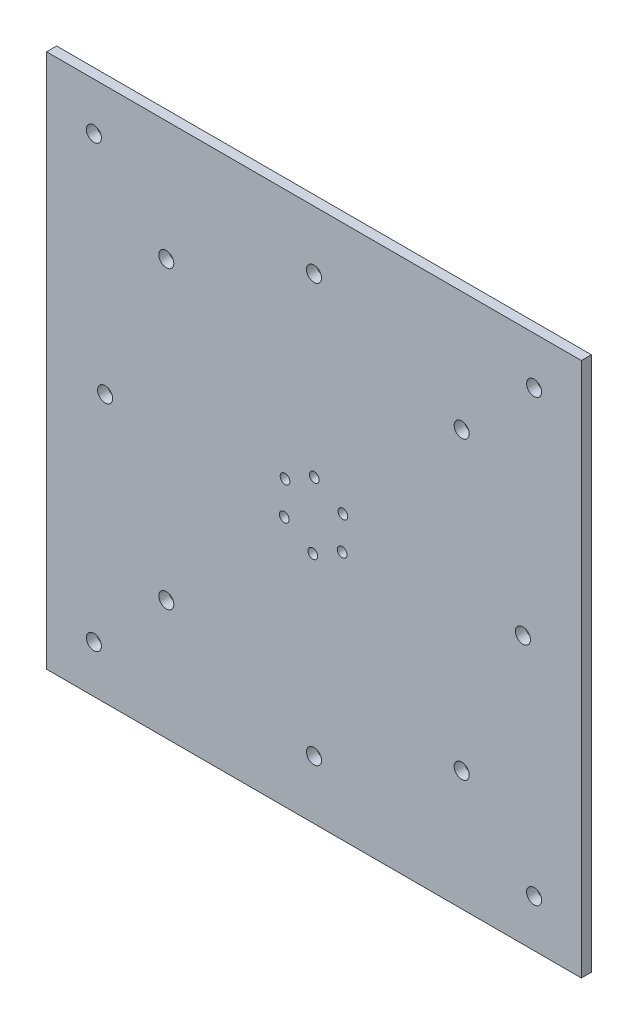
ISO-10303-21;
HEADER;
FILE_DESCRIPTION(('STEP AP214'),'2;1');
FILE_NAME('part.step','',(''),(''),'','','');
FILE_SCHEMA(('AUTOMOTIVE_DESIGN { 1 0 10303 214 1 1 1 1 }'));
ENDSEC;
DATA;
#1=APPLICATION_CONTEXT('core data for automotive mechanical design processes');
#2=APPLICATION_PROTOCOL_DEFINITION('international standard','automotive_design',2000,#1);
#3=PRODUCT_CONTEXT('',#1,'mechanical');
#4=PRODUCT('Part','Part','',(#3));
#5=PRODUCT_RELATED_PRODUCT_CATEGORY('part','',(#4));
#6=PRODUCT_DEFINITION_FORMATION('','',#4);
#7=PRODUCT_DEFINITION_CONTEXT('part definition',#1,'design');
#8=PRODUCT_DEFINITION('design','',#6,#7);
#9=PRODUCT_DEFINITION_SHAPE('','',#8);
#10=(LENGTH_UNIT() NAMED_UNIT(*) SI_UNIT(.MILLI.,.METRE.));
#11=(NAMED_UNIT(*) PLANE_ANGLE_UNIT() SI_UNIT($,.RADIAN.));
#12=(NAMED_UNIT(*) SI_UNIT($,.STERADIAN.) SOLID_ANGLE_UNIT());
#13=UNCERTAINTY_MEASURE_WITH_UNIT(LENGTH_MEASURE(1.E-05),#10,'distance_accuracy_value','');
#14=(GEOMETRIC_REPRESENTATION_CONTEXT(3) GLOBAL_UNCERTAINTY_ASSIGNED_CONTEXT((#13)) GLOBAL_UNIT_ASSIGNED_CONTEXT((#10,
#11,#12)) REPRESENTATION_CONTEXT('',''));
#15=CARTESIAN_POINT('',(0.,0.,0.));
#16=DIRECTION('',(0.,0.,1.));
#17=DIRECTION('',(1.,0.,0.));
#18=AXIS2_PLACEMENT_3D('',#15,#16,#17);
#19=CARTESIAN_POINT('',(0.,-80.,3.));
#20=DIRECTION('',(0.,-1.,0.));
#21=DIRECTION('',(0.,0.,-1.));
#22=AXIS2_PLACEMENT_3D('',#19,#20,#21);
#23=PLANE('',#22);
#24=DIRECTION('',(-1.,0.,0.));
#25=VECTOR('',#24,1.);
#26=CARTESIAN_POINT('',(0.,-80.,0.));
#27=LINE('',#26,#25);
#28=CARTESIAN_POINT('',(80.,-80.,0.));
#29=VERTEX_POINT('',#28);
#30=CARTESIAN_POINT('',(-80.,-80.,0.));
#31=VERTEX_POINT('',#30);
#32=EDGE_CURVE('E98',#29,#31,#27,.T.);
#33=ORIENTED_EDGE('',*,*,#32,.F.);
#34=DIRECTION('',(0.,0.,-1.));
#35=VECTOR('',#34,1.);
#36=CARTESIAN_POINT('',(80.,-80.,3.));
#37=LINE('',#36,#35);
#38=CARTESIAN_POINT('',(80.,-80.,3.));
#39=VERTEX_POINT('',#38);
#40=EDGE_CURVE('E11',#39,#29,#37,.T.);
#41=ORIENTED_EDGE('',*,*,#40,.F.);
#42=DIRECTION('',(-1.,0.,0.));
#43=VECTOR('',#42,1.);
#44=CARTESIAN_POINT('',(0.,-80.,3.));
#45=LINE('',#44,#43);
#46=CARTESIAN_POINT('',(-80.,-80.,3.));
#47=VERTEX_POINT('',#46);
#48=EDGE_CURVE('E83',#39,#47,#45,.T.);
#49=ORIENTED_EDGE('',*,*,#48,.T.);
#50=DIRECTION('',(0.,0.,-1.));
#51=VECTOR('',#50,1.);
#52=CARTESIAN_POINT('',(-80.,-80.,3.));
#53=LINE('',#52,#51);
#54=EDGE_CURVE('E51',#47,#31,#53,.T.);
#55=ORIENTED_EDGE('',*,*,#54,.T.);
#56=EDGE_LOOP('',(#33,#41,#49,#55));
#57=FACE_BOUND('',#56,.T.);
#58=ADVANCED_FACE('F35',(#57),#23,.T.);
#59=CARTESIAN_POINT('',(80.,0.,3.));
#60=DIRECTION('',(-1.,0.,0.));
#61=DIRECTION('',(0.,0.,1.));
#62=AXIS2_PLACEMENT_3D('',#59,#60,#61);
#63=PLANE('',#62);
#64=DIRECTION('',(0.,1.,0.));
#65=VECTOR('',#64,1.);
#66=CARTESIAN_POINT('',(80.,0.,0.));
#67=LINE('',#66,#65);
#68=CARTESIAN_POINT('',(80.,80.,0.));
#69=VERTEX_POINT('',#68);
#70=EDGE_CURVE('E89',#29,#69,#67,.T.);
#71=ORIENTED_EDGE('',*,*,#70,.T.);
#72=DIRECTION('',(0.,0.,-1.));
#73=VECTOR('',#72,1.);
#74=CARTESIAN_POINT('',(80.,80.,3.));
#75=LINE('',#74,#73);
#76=CARTESIAN_POINT('',(80.,80.,3.));
#77=VERTEX_POINT('',#76);
#78=EDGE_CURVE('E43',#77,#69,#75,.T.);
#79=ORIENTED_EDGE('',*,*,#78,.F.);
#80=DIRECTION('',(0.,1.,0.));
#81=VECTOR('',#80,1.);
#82=CARTESIAN_POINT('',(80.,0.,3.));
#83=LINE('',#82,#81);
#84=EDGE_CURVE('E77',#39,#77,#83,.T.);
#85=ORIENTED_EDGE('',*,*,#84,.F.);
#86=ORIENTED_EDGE('',*,*,#40,.T.);
#87=EDGE_LOOP('',(#71,#79,#85,#86));
#88=FACE_BOUND('',#87,.T.);
#89=ADVANCED_FACE('F87',(#88),#63,.F.);
#90=CARTESIAN_POINT('',(0.,80.,3.));
#91=DIRECTION('',(0.,-1.,0.));
#92=DIRECTION('',(0.,0.,-1.));
#93=AXIS2_PLACEMENT_3D('',#90,#91,#92);
#94=PLANE('',#93);
#95=DIRECTION('',(-1.,0.,0.));
#96=VECTOR('',#95,1.);
#97=CARTESIAN_POINT('',(0.,80.,0.));
#98=LINE('',#97,#96);
#99=CARTESIAN_POINT('',(-80.,80.,0.));
#100=VERTEX_POINT('',#99);
#101=EDGE_CURVE('E102',#69,#100,#98,.T.);
#102=ORIENTED_EDGE('',*,*,#101,.T.);
#103=DIRECTION('',(0.,0.,-1.));
#104=VECTOR('',#103,1.);
#105=CARTESIAN_POINT('',(-80.,80.,3.));
#106=LINE('',#105,#104);
#107=CARTESIAN_POINT('',(-80.,80.,3.));
#108=VERTEX_POINT('',#107);
#109=EDGE_CURVE('E65',#108,#100,#106,.T.);
#110=ORIENTED_EDGE('',*,*,#109,.F.);
#111=DIRECTION('',(-1.,0.,0.));
#112=VECTOR('',#111,1.);
#113=CARTESIAN_POINT('',(0.,80.,3.));
#114=LINE('',#113,#112);
#115=EDGE_CURVE('E82',#77,#108,#114,.T.);
#116=ORIENTED_EDGE('',*,*,#115,.F.);
#117=ORIENTED_EDGE('',*,*,#78,.T.);
#118=EDGE_LOOP('',(#102,#110,#116,#117));
#119=FACE_BOUND('',#118,.T.);
#120=ADVANCED_FACE('F92',(#119),#94,.F.);
#121=CARTESIAN_POINT('',(-80.,0.,3.));
#122=DIRECTION('',(-1.,0.,0.));
#123=DIRECTION('',(0.,0.,1.));
#124=AXIS2_PLACEMENT_3D('',#121,#122,#123);
#125=PLANE('',#124);
#126=DIRECTION('',(0.,1.,0.));
#127=VECTOR('',#126,1.);
#128=CARTESIAN_POINT('',(-80.,0.,0.));
#129=LINE('',#128,#127);
#130=EDGE_CURVE('E104',#31,#100,#129,.T.);
#131=ORIENTED_EDGE('',*,*,#130,.F.);
#132=ORIENTED_EDGE('',*,*,#54,.F.);
#133=DIRECTION('',(0.,1.,0.));
#134=VECTOR('',#133,1.);
#135=CARTESIAN_POINT('',(-80.,0.,3.));
#136=LINE('',#135,#134);
#137=EDGE_CURVE('E93',#47,#108,#136,.T.);
#138=ORIENTED_EDGE('',*,*,#137,.T.);
#139=ORIENTED_EDGE('',*,*,#109,.T.);
#140=EDGE_LOOP('',(#131,#132,#138,#139));
#141=FACE_BOUND('',#140,.T.);
#142=ADVANCED_FACE('F258',(#141),#125,.T.);
#143=CARTESIAN_POINT('',(0.,0.,3.));
#144=DIRECTION('',(0.,0.,1.));
#145=DIRECTION('',(1.,0.,0.));
#146=AXIS2_PLACEMENT_3D('',#143,#144,#145);
#147=PLANE('',#146);
#148=CARTESIAN_POINT('',(0.,62.5,3.));
#149=DIRECTION('',(0.,0.,-1.));
#150=DIRECTION('',(-1.,0.,0.));
#151=AXIS2_PLACEMENT_3D('',#148,#149,#150);
#152=CIRCLE('',#151,2.25);
#153=CARTESIAN_POINT('',(-2.25,62.5,3.));
#154=VERTEX_POINT('',#153);
#155=EDGE_CURVE('E211',#154,#154,#152,.T.);
#156=ORIENTED_EDGE('',*,*,#155,.T.);
#157=EDGE_LOOP('',(#156));
#158=FACE_BOUND('',#157,.T.);
#159=CARTESIAN_POINT('',(-44.1941738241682,44.1941738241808,3.));
#160=DIRECTION('',(0.,0.,-1.));
#161=DIRECTION('',(-1.,0.,0.));
#162=AXIS2_PLACEMENT_3D('',#159,#160,#161);
#163=CIRCLE('',#162,2.25);
#164=CARTESIAN_POINT('',(-46.4441738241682,44.1941738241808,3.));
#165=VERTEX_POINT('',#164);
#166=EDGE_CURVE('E205',#165,#165,#163,.T.);
#167=ORIENTED_EDGE('',*,*,#166,.T.);
#168=EDGE_LOOP('',(#167));
#169=FACE_BOUND('',#168,.T.);
#170=CARTESIAN_POINT('',(-62.5000000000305,3.05196521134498E-11,3.));
#171=DIRECTION('',(0.,0.,-1.));
#172=DIRECTION('',(-1.,0.,0.));
#173=AXIS2_PLACEMENT_3D('',#170,#171,#172);
#174=CIRCLE('',#173,2.25);
#175=CARTESIAN_POINT('',(-64.7500000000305,3.05196521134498E-11,3.));
#176=VERTEX_POINT('',#175);
#177=EDGE_CURVE('E199',#176,#176,#174,.T.);
#178=ORIENTED_EDGE('',*,*,#177,.T.);
#179=EDGE_LOOP('',(#178));
#180=FACE_BOUND('',#179,.T.);
#181=CARTESIAN_POINT('',(-44.1941738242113,-44.1941738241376,3.));
#182=DIRECTION('',(0.,0.,-1.));
#183=DIRECTION('',(-1.,0.,0.));
#184=AXIS2_PLACEMENT_3D('',#181,#182,#183);
#185=CIRCLE('',#184,2.25);
#186=CARTESIAN_POINT('',(-46.4441738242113,-44.1941738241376,3.));
#187=VERTEX_POINT('',#186);
#188=EDGE_CURVE('E193',#187,#187,#185,.T.);
#189=ORIENTED_EDGE('',*,*,#188,.T.);
#190=EDGE_LOOP('',(#189));
#191=FACE_BOUND('',#190,.T.);
#192=CARTESIAN_POINT('',(-6.10393042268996E-11,-62.5,3.));
#193=DIRECTION('',(0.,0.,-1.));
#194=DIRECTION('',(-1.,0.,0.));
#195=AXIS2_PLACEMENT_3D('',#192,#193,#194);
#196=CIRCLE('',#195,2.25);
#197=CARTESIAN_POINT('',(-2.25000000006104,-62.5,3.));
#198=VERTEX_POINT('',#197);
#199=EDGE_CURVE('E187',#198,#198,#196,.T.);
#200=ORIENTED_EDGE('',*,*,#199,.T.);
#201=EDGE_LOOP('',(#200));
#202=FACE_BOUND('',#201,.T.);
#203=CARTESIAN_POINT('',(44.1941738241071,-44.1941738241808,3.));
#204=DIRECTION('',(0.,0.,-1.));
#205=DIRECTION('',(-1.,0.,0.));
#206=AXIS2_PLACEMENT_3D('',#203,#204,#205);
#207=CIRCLE('',#206,2.25);
#208=CARTESIAN_POINT('',(41.9441738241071,-44.1941738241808,3.));
#209=VERTEX_POINT('',#208);
#210=EDGE_CURVE('E181',#209,#209,#207,.T.);
#211=ORIENTED_EDGE('',*,*,#210,.T.);
#212=EDGE_LOOP('',(#211));
#213=FACE_BOUND('',#212,.T.);
#214=CARTESIAN_POINT('',(62.4999999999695,-3.05273061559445E-11,3.));
#215=DIRECTION('',(0.,0.,-1.));
#216=DIRECTION('',(-1.,0.,0.));
#217=AXIS2_PLACEMENT_3D('',#214,#215,#216);
#218=CIRCLE('',#217,2.25);
#219=CARTESIAN_POINT('',(60.2499999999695,-3.05273061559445E-11,3.));
#220=VERTEX_POINT('',#219);
#221=EDGE_CURVE('E175',#220,#220,#218,.T.);
#222=ORIENTED_EDGE('',*,*,#221,.T.);
#223=EDGE_LOOP('',(#222));
#224=FACE_BOUND('',#223,.T.);
#225=CARTESIAN_POINT('',(44.1941738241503,44.1941738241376,3.));
#226=DIRECTION('',(0.,0.,-1.));
#227=DIRECTION('',(-1.,0.,0.));
#228=AXIS2_PLACEMENT_3D('',#225,#226,#227);
#229=CIRCLE('',#228,2.25);
#230=CARTESIAN_POINT('',(41.9441738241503,44.1941738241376,3.));
#231=VERTEX_POINT('',#230);
#232=EDGE_CURVE('E169',#231,#231,#229,.T.);
#233=ORIENTED_EDGE('',*,*,#232,.T.);
#234=EDGE_LOOP('',(#233));
#235=FACE_BOUND('',#234,.T.);
#236=CARTESIAN_POINT('',(65.857864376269,65.8578643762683,3.));
#237=DIRECTION('',(0.,0.,-1.));
#238=DIRECTION('',(-1.,0.,0.));
#239=AXIS2_PLACEMENT_3D('',#236,#237,#238);
#240=CIRCLE('',#239,2.25);
#241=CARTESIAN_POINT('',(63.607864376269,65.8578643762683,3.));
#242=VERTEX_POINT('',#241);
#243=EDGE_CURVE('E163',#242,#242,#240,.T.);
#244=ORIENTED_EDGE('',*,*,#243,.T.);
#245=EDGE_LOOP('',(#244));
#246=FACE_BOUND('',#245,.T.);
#247=CARTESIAN_POINT('',(-65.8578643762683,65.8578643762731,3.));
#248=DIRECTION('',(0.,0.,-1.));
#249=DIRECTION('',(-1.,0.,0.));
#250=AXIS2_PLACEMENT_3D('',#247,#248,#249);
#251=CIRCLE('',#250,2.25);
#252=CARTESIAN_POINT('',(-68.1078643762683,65.8578643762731,3.));
#253=VERTEX_POINT('',#252);
#254=EDGE_CURVE('E157',#253,#253,#251,.T.);
#255=ORIENTED_EDGE('',*,*,#254,.T.);
#256=EDGE_LOOP('',(#255));
#257=FACE_BOUND('',#256,.T.);
#258=CARTESIAN_POINT('',(-65.8578643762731,-65.8578643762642,3.));
#259=DIRECTION('',(0.,0.,-1.));
#260=DIRECTION('',(-1.,0.,0.));
#261=AXIS2_PLACEMENT_3D('',#258,#259,#260);
#262=CIRCLE('',#261,2.25);
#263=CARTESIAN_POINT('',(-68.1078643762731,-65.8578643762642,3.));
#264=VERTEX_POINT('',#263);
#265=EDGE_CURVE('E151',#264,#264,#262,.T.);
#266=ORIENTED_EDGE('',*,*,#265,.T.);
#267=EDGE_LOOP('',(#266));
#268=FACE_BOUND('',#267,.T.);
#269=CARTESIAN_POINT('',(65.8578643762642,-65.857864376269,3.));
#270=DIRECTION('',(0.,0.,-1.));
#271=DIRECTION('',(-1.,0.,0.));
#272=AXIS2_PLACEMENT_3D('',#269,#270,#271);
#273=CIRCLE('',#272,2.25);
#274=CARTESIAN_POINT('',(63.6078643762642,-65.857864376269,3.));
#275=VERTEX_POINT('',#274);
#276=EDGE_CURVE('E145',#275,#275,#273,.T.);
#277=ORIENTED_EDGE('',*,*,#276,.T.);
#278=EDGE_LOOP('',(#277));
#279=FACE_BOUND('',#278,.T.);
#280=CARTESIAN_POINT('',(0.113783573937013,9.797526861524,3.));
#281=DIRECTION('',(0.,0.,-1.));
#282=DIRECTION('',(-1.,0.,0.));
#283=AXIS2_PLACEMENT_3D('',#280,#281,#282);
#284=CIRCLE('',#283,1.45);
#285=CARTESIAN_POINT('',(-1.33621642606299,9.797526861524,3.));
#286=VERTEX_POINT('',#285);
#287=EDGE_CURVE('E139',#286,#286,#284,.T.);
#288=ORIENTED_EDGE('',*,*,#287,.T.);
#289=EDGE_LOOP('',(#288));
#290=FACE_BOUND('',#289,.T.);
#291=CARTESIAN_POINT('',(-8.66025403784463,5.00000000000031,3.));
#292=DIRECTION('',(0.,0.,-1.));
#293=DIRECTION('',(-1.,0.,0.));
#294=AXIS2_PLACEMENT_3D('',#291,#292,#293);
#295=CIRCLE('',#294,1.45);
#296=CARTESIAN_POINT('',(-10.1102540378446,5.00000000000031,3.));
#297=VERTEX_POINT('',#296);
#298=EDGE_CURVE('E133',#297,#297,#295,.T.);
#299=ORIENTED_EDGE('',*,*,#298,.T.);
#300=EDGE_LOOP('',(#299));
#301=FACE_BOUND('',#300,.T.);
#302=CARTESIAN_POINT('',(-8.89249270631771,-4.99730289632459,3.));
#303=DIRECTION('',(0.,0.,-1.));
#304=DIRECTION('',(-1.,0.,0.));
#305=AXIS2_PLACEMENT_3D('',#302,#303,#304);
#306=CIRCLE('',#305,1.45);
#307=CARTESIAN_POINT('',(-10.3424927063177,-4.99730289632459,3.));
#308=VERTEX_POINT('',#307);
#309=EDGE_CURVE('E127',#308,#308,#306,.T.);
#310=ORIENTED_EDGE('',*,*,#309,.T.);
#311=EDGE_LOOP('',(#310));
#312=FACE_BOUND('',#311,.T.);
#313=CARTESIAN_POINT('',(-0.350693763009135,-10.1970789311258,3.));
#314=DIRECTION('',(0.,0.,-1.));
#315=DIRECTION('',(-1.,0.,0.));
#316=AXIS2_PLACEMENT_3D('',#313,#314,#315);
#317=CIRCLE('',#316,1.45);
#318=CARTESIAN_POINT('',(-1.80069376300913,-10.1970789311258,3.));
#319=VERTEX_POINT('',#318);
#320=EDGE_CURVE('E121',#319,#319,#317,.T.);
#321=ORIENTED_EDGE('',*,*,#320,.T.);
#322=EDGE_LOOP('',(#321));
#323=FACE_BOUND('',#322,.T.);
#324=CARTESIAN_POINT('',(8.42334384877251,-5.39955206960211,3.));
#325=DIRECTION('',(0.,0.,-1.));
#326=DIRECTION('',(-1.,0.,0.));
#327=AXIS2_PLACEMENT_3D('',#324,#325,#326);
#328=CIRCLE('',#327,1.45);
#329=CARTESIAN_POINT('',(6.97334384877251,-5.39955206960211,3.));
#330=VERTEX_POINT('',#329);
#331=EDGE_CURVE('E115',#330,#330,#328,.T.);
#332=ORIENTED_EDGE('',*,*,#331,.T.);
#333=EDGE_LOOP('',(#332));
#334=FACE_BOUND('',#333,.T.);
#335=CARTESIAN_POINT('',(8.65558251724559,4.5977508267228,3.));
#336=DIRECTION('',(0.,0.,-1.));
#337=DIRECTION('',(-1.,0.,0.));
#338=AXIS2_PLACEMENT_3D('',#335,#336,#337);
#339=CIRCLE('',#338,1.45);
#340=CARTESIAN_POINT('',(7.20558251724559,4.5977508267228,3.));
#341=VERTEX_POINT('',#340);
#342=EDGE_CURVE('E100',#341,#341,#339,.T.);
#343=ORIENTED_EDGE('',*,*,#342,.T.);
#344=EDGE_LOOP('',(#343));
#345=FACE_BOUND('',#344,.T.);
#346=ORIENTED_EDGE('',*,*,#48,.F.);
#347=ORIENTED_EDGE('',*,*,#84,.T.);
#348=ORIENTED_EDGE('',*,*,#115,.T.);
#349=ORIENTED_EDGE('',*,*,#137,.F.);
#350=EDGE_LOOP('',(#346,#347,#348,#349));
#351=FACE_BOUND('',#350,.T.);
#352=ADVANCED_FACE('F79',(#158,#169,#180,#191,#202,#213,#224,#235,#246,#257,#268,#279,#290,#301,
#312,#323,#334,#345,#351),#147,.T.);
#353=CARTESIAN_POINT('',(0.,0.,0.));
#354=DIRECTION('',(0.,0.,1.));
#355=DIRECTION('',(1.,0.,0.));
#356=AXIS2_PLACEMENT_3D('',#353,#354,#355);
#357=PLANE('',#356);
#358=CARTESIAN_POINT('',(0.,62.5,0.));
#359=DIRECTION('',(0.,0.,-1.));
#360=DIRECTION('',(-1.,0.,0.));
#361=AXIS2_PLACEMENT_3D('',#358,#359,#360);
#362=CIRCLE('',#361,2.25);
#363=CARTESIAN_POINT('',(-2.25,62.5,0.));
#364=VERTEX_POINT('',#363);
#365=EDGE_CURVE('E214',#364,#364,#362,.T.);
#366=ORIENTED_EDGE('',*,*,#365,.F.);
#367=EDGE_LOOP('',(#366));
#368=FACE_BOUND('',#367,.T.);
#369=CARTESIAN_POINT('',(-44.1941738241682,44.1941738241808,0.));
#370=DIRECTION('',(0.,0.,-1.));
#371=DIRECTION('',(-1.,0.,0.));
#372=AXIS2_PLACEMENT_3D('',#369,#370,#371);
#373=CIRCLE('',#372,2.25);
#374=CARTESIAN_POINT('',(-46.4441738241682,44.1941738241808,0.));
#375=VERTEX_POINT('',#374);
#376=EDGE_CURVE('E208',#375,#375,#373,.T.);
#377=ORIENTED_EDGE('',*,*,#376,.F.);
#378=EDGE_LOOP('',(#377));
#379=FACE_BOUND('',#378,.T.);
#380=CARTESIAN_POINT('',(-62.5000000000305,3.05196521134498E-11,0.));
#381=DIRECTION('',(0.,0.,-1.));
#382=DIRECTION('',(-1.,0.,0.));
#383=AXIS2_PLACEMENT_3D('',#380,#381,#382);
#384=CIRCLE('',#383,2.25);
#385=CARTESIAN_POINT('',(-64.7500000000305,3.05196521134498E-11,0.));
#386=VERTEX_POINT('',#385);
#387=EDGE_CURVE('E202',#386,#386,#384,.T.);
#388=ORIENTED_EDGE('',*,*,#387,.F.);
#389=EDGE_LOOP('',(#388));
#390=FACE_BOUND('',#389,.T.);
#391=CARTESIAN_POINT('',(-44.1941738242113,-44.1941738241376,0.));
#392=DIRECTION('',(0.,0.,-1.));
#393=DIRECTION('',(-1.,0.,0.));
#394=AXIS2_PLACEMENT_3D('',#391,#392,#393);
#395=CIRCLE('',#394,2.25);
#396=CARTESIAN_POINT('',(-46.4441738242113,-44.1941738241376,0.));
#397=VERTEX_POINT('',#396);
#398=EDGE_CURVE('E196',#397,#397,#395,.T.);
#399=ORIENTED_EDGE('',*,*,#398,.F.);
#400=EDGE_LOOP('',(#399));
#401=FACE_BOUND('',#400,.T.);
#402=CARTESIAN_POINT('',(-6.10393042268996E-11,-62.5,0.));
#403=DIRECTION('',(0.,0.,-1.));
#404=DIRECTION('',(-1.,0.,0.));
#405=AXIS2_PLACEMENT_3D('',#402,#403,#404);
#406=CIRCLE('',#405,2.25);
#407=CARTESIAN_POINT('',(-2.25000000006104,-62.5,0.));
#408=VERTEX_POINT('',#407);
#409=EDGE_CURVE('E190',#408,#408,#406,.T.);
#410=ORIENTED_EDGE('',*,*,#409,.F.);
#411=EDGE_LOOP('',(#410));
#412=FACE_BOUND('',#411,.T.);
#413=CARTESIAN_POINT('',(44.1941738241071,-44.1941738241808,0.));
#414=DIRECTION('',(0.,0.,-1.));
#415=DIRECTION('',(-1.,0.,0.));
#416=AXIS2_PLACEMENT_3D('',#413,#414,#415);
#417=CIRCLE('',#416,2.25);
#418=CARTESIAN_POINT('',(41.9441738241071,-44.1941738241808,0.));
#419=VERTEX_POINT('',#418);
#420=EDGE_CURVE('E184',#419,#419,#417,.T.);
#421=ORIENTED_EDGE('',*,*,#420,.F.);
#422=EDGE_LOOP('',(#421));
#423=FACE_BOUND('',#422,.T.);
#424=CARTESIAN_POINT('',(62.4999999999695,-3.05273061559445E-11,0.));
#425=DIRECTION('',(0.,0.,-1.));
#426=DIRECTION('',(-1.,0.,0.));
#427=AXIS2_PLACEMENT_3D('',#424,#425,#426);
#428=CIRCLE('',#427,2.25);
#429=CARTESIAN_POINT('',(60.2499999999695,-3.05273061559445E-11,0.));
#430=VERTEX_POINT('',#429);
#431=EDGE_CURVE('E178',#430,#430,#428,.T.);
#432=ORIENTED_EDGE('',*,*,#431,.F.);
#433=EDGE_LOOP('',(#432));
#434=FACE_BOUND('',#433,.T.);
#435=CARTESIAN_POINT('',(44.1941738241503,44.1941738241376,0.));
#436=DIRECTION('',(0.,0.,-1.));
#437=DIRECTION('',(-1.,0.,0.));
#438=AXIS2_PLACEMENT_3D('',#435,#436,#437);
#439=CIRCLE('',#438,2.25);
#440=CARTESIAN_POINT('',(41.9441738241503,44.1941738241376,0.));
#441=VERTEX_POINT('',#440);
#442=EDGE_CURVE('E172',#441,#441,#439,.T.);
#443=ORIENTED_EDGE('',*,*,#442,.F.);
#444=EDGE_LOOP('',(#443));
#445=FACE_BOUND('',#444,.T.);
#446=CARTESIAN_POINT('',(65.857864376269,65.8578643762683,0.));
#447=DIRECTION('',(0.,0.,-1.));
#448=DIRECTION('',(-1.,0.,0.));
#449=AXIS2_PLACEMENT_3D('',#446,#447,#448);
#450=CIRCLE('',#449,2.25);
#451=CARTESIAN_POINT('',(63.607864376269,65.8578643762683,0.));
#452=VERTEX_POINT('',#451);
#453=EDGE_CURVE('E166',#452,#452,#450,.T.);
#454=ORIENTED_EDGE('',*,*,#453,.F.);
#455=EDGE_LOOP('',(#454));
#456=FACE_BOUND('',#455,.T.);
#457=CARTESIAN_POINT('',(-65.8578643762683,65.8578643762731,0.));
#458=DIRECTION('',(0.,0.,-1.));
#459=DIRECTION('',(-1.,0.,0.));
#460=AXIS2_PLACEMENT_3D('',#457,#458,#459);
#461=CIRCLE('',#460,2.25);
#462=CARTESIAN_POINT('',(-68.1078643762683,65.8578643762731,0.));
#463=VERTEX_POINT('',#462);
#464=EDGE_CURVE('E160',#463,#463,#461,.T.);
#465=ORIENTED_EDGE('',*,*,#464,.F.);
#466=EDGE_LOOP('',(#465));
#467=FACE_BOUND('',#466,.T.);
#468=CARTESIAN_POINT('',(-65.8578643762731,-65.8578643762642,0.));
#469=DIRECTION('',(0.,0.,-1.));
#470=DIRECTION('',(-1.,0.,0.));
#471=AXIS2_PLACEMENT_3D('',#468,#469,#470);
#472=CIRCLE('',#471,2.25);
#473=CARTESIAN_POINT('',(-68.1078643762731,-65.8578643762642,0.));
#474=VERTEX_POINT('',#473);
#475=EDGE_CURVE('E154',#474,#474,#472,.T.);
#476=ORIENTED_EDGE('',*,*,#475,.F.);
#477=EDGE_LOOP('',(#476));
#478=FACE_BOUND('',#477,.T.);
#479=CARTESIAN_POINT('',(65.8578643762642,-65.857864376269,0.));
#480=DIRECTION('',(0.,0.,-1.));
#481=DIRECTION('',(-1.,0.,0.));
#482=AXIS2_PLACEMENT_3D('',#479,#480,#481);
#483=CIRCLE('',#482,2.25);
#484=CARTESIAN_POINT('',(63.6078643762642,-65.857864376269,0.));
#485=VERTEX_POINT('',#484);
#486=EDGE_CURVE('E148',#485,#485,#483,.T.);
#487=ORIENTED_EDGE('',*,*,#486,.F.);
#488=EDGE_LOOP('',(#487));
#489=FACE_BOUND('',#488,.T.);
#490=CARTESIAN_POINT('',(0.113783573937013,9.797526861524,0.));
#491=DIRECTION('',(0.,0.,-1.));
#492=DIRECTION('',(-1.,0.,0.));
#493=AXIS2_PLACEMENT_3D('',#490,#491,#492);
#494=CIRCLE('',#493,1.44999999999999);
#495=CARTESIAN_POINT('',(-1.33621642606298,9.797526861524,0.));
#496=VERTEX_POINT('',#495);
#497=EDGE_CURVE('E142',#496,#496,#494,.T.);
#498=ORIENTED_EDGE('',*,*,#497,.F.);
#499=EDGE_LOOP('',(#498));
#500=FACE_BOUND('',#499,.T.);
#501=CARTESIAN_POINT('',(-8.66025403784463,5.00000000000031,0.));
#502=DIRECTION('',(0.,0.,-1.));
#503=DIRECTION('',(-1.,0.,0.));
#504=AXIS2_PLACEMENT_3D('',#501,#502,#503);
#505=CIRCLE('',#504,1.44999999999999);
#506=CARTESIAN_POINT('',(-10.1102540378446,5.00000000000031,0.));
#507=VERTEX_POINT('',#506);
#508=EDGE_CURVE('E136',#507,#507,#505,.T.);
#509=ORIENTED_EDGE('',*,*,#508,.F.);
#510=EDGE_LOOP('',(#509));
#511=FACE_BOUND('',#510,.T.);
#512=CARTESIAN_POINT('',(-8.89249270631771,-4.99730289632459,0.));
#513=DIRECTION('',(0.,0.,-1.));
#514=DIRECTION('',(-1.,0.,0.));
#515=AXIS2_PLACEMENT_3D('',#512,#513,#514);
#516=CIRCLE('',#515,1.44999999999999);
#517=CARTESIAN_POINT('',(-10.3424927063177,-4.99730289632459,0.));
#518=VERTEX_POINT('',#517);
#519=EDGE_CURVE('E130',#518,#518,#516,.T.);
#520=ORIENTED_EDGE('',*,*,#519,.F.);
#521=EDGE_LOOP('',(#520));
#522=FACE_BOUND('',#521,.T.);
#523=CARTESIAN_POINT('',(-0.350693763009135,-10.1970789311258,0.));
#524=DIRECTION('',(0.,0.,-1.));
#525=DIRECTION('',(-1.,0.,0.));
#526=AXIS2_PLACEMENT_3D('',#523,#524,#525);
#527=CIRCLE('',#526,1.44999999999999);
#528=CARTESIAN_POINT('',(-1.80069376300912,-10.1970789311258,0.));
#529=VERTEX_POINT('',#528);
#530=EDGE_CURVE('E124',#529,#529,#527,.T.);
#531=ORIENTED_EDGE('',*,*,#530,.F.);
#532=EDGE_LOOP('',(#531));
#533=FACE_BOUND('',#532,.T.);
#534=CARTESIAN_POINT('',(8.42334384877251,-5.39955206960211,0.));
#535=DIRECTION('',(0.,0.,-1.));
#536=DIRECTION('',(-1.,0.,0.));
#537=AXIS2_PLACEMENT_3D('',#534,#535,#536);
#538=CIRCLE('',#537,1.44999999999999);
#539=CARTESIAN_POINT('',(6.97334384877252,-5.39955206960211,0.));
#540=VERTEX_POINT('',#539);
#541=EDGE_CURVE('E118',#540,#540,#538,.T.);
#542=ORIENTED_EDGE('',*,*,#541,.F.);
#543=EDGE_LOOP('',(#542));
#544=FACE_BOUND('',#543,.T.);
#545=CARTESIAN_POINT('',(8.65558251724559,4.5977508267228,0.));
#546=DIRECTION('',(0.,0.,-1.));
#547=DIRECTION('',(-1.,0.,0.));
#548=AXIS2_PLACEMENT_3D('',#545,#546,#547);
#549=CIRCLE('',#548,1.44999999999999);
#550=CARTESIAN_POINT('',(7.2055825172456,4.5977508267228,0.));
#551=VERTEX_POINT('',#550);
#552=EDGE_CURVE('E112',#551,#551,#549,.T.);
#553=ORIENTED_EDGE('',*,*,#552,.F.);
#554=EDGE_LOOP('',(#553));
#555=FACE_BOUND('',#554,.T.);
#556=ORIENTED_EDGE('',*,*,#32,.T.);
#557=ORIENTED_EDGE('',*,*,#130,.T.);
#558=ORIENTED_EDGE('',*,*,#101,.F.);
#559=ORIENTED_EDGE('',*,*,#70,.F.);
#560=EDGE_LOOP('',(#556,#557,#558,#559));
#561=FACE_BOUND('',#560,.T.);
#562=ADVANCED_FACE('F220',(#368,#379,#390,#401,#412,#423,#434,#445,#456,#467,#478,#489,#500,
#511,#522,#533,#544,#555,#561),#357,.F.);
#563=CARTESIAN_POINT('',(8.65558251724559,4.5977508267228,0.));
#564=DIRECTION('',(0.,0.,-1.));
#565=DIRECTION('',(-1.,0.,0.));
#566=AXIS2_PLACEMENT_3D('',#563,#564,#565);
#567=CYLINDRICAL_SURFACE('',#566,1.44999999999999);
#568=ORIENTED_EDGE('',*,*,#342,.F.);
#569=EDGE_LOOP('',(#568));
#570=FACE_BOUND('',#569,.T.);
#571=ORIENTED_EDGE('',*,*,#552,.T.);
#572=EDGE_LOOP('',(#571));
#573=FACE_BOUND('',#572,.T.);
#574=ADVANCED_FACE('F223',(#570,#573),#567,.F.);
#575=CARTESIAN_POINT('',(8.42334384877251,-5.39955206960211,0.));
#576=DIRECTION('',(0.,0.,-1.));
#577=DIRECTION('',(-1.,0.,0.));
#578=AXIS2_PLACEMENT_3D('',#575,#576,#577);
#579=CYLINDRICAL_SURFACE('',#578,1.44999999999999);
#580=ORIENTED_EDGE('',*,*,#331,.F.);
#581=EDGE_LOOP('',(#580));
#582=FACE_BOUND('',#581,.T.);
#583=ORIENTED_EDGE('',*,*,#541,.T.);
#584=EDGE_LOOP('',(#583));
#585=FACE_BOUND('',#584,.T.);
#586=ADVANCED_FACE('F292',(#582,#585),#579,.F.);
#587=CARTESIAN_POINT('',(-0.350693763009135,-10.1970789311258,0.));
#588=DIRECTION('',(0.,0.,-1.));
#589=DIRECTION('',(-1.,0.,0.));
#590=AXIS2_PLACEMENT_3D('',#587,#588,#589);
#591=CYLINDRICAL_SURFACE('',#590,1.44999999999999);
#592=ORIENTED_EDGE('',*,*,#320,.F.);
#593=EDGE_LOOP('',(#592));
#594=FACE_BOUND('',#593,.T.);
#595=ORIENTED_EDGE('',*,*,#530,.T.);
#596=EDGE_LOOP('',(#595));
#597=FACE_BOUND('',#596,.T.);
#598=ADVANCED_FACE('F303',(#594,#597),#591,.F.);
#599=CARTESIAN_POINT('',(-8.89249270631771,-4.99730289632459,0.));
#600=DIRECTION('',(0.,0.,-1.));
#601=DIRECTION('',(-1.,0.,0.));
#602=AXIS2_PLACEMENT_3D('',#599,#600,#601);
#603=CYLINDRICAL_SURFACE('',#602,1.44999999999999);
#604=ORIENTED_EDGE('',*,*,#309,.F.);
#605=EDGE_LOOP('',(#604));
#606=FACE_BOUND('',#605,.T.);
#607=ORIENTED_EDGE('',*,*,#519,.T.);
#608=EDGE_LOOP('',(#607));
#609=FACE_BOUND('',#608,.T.);
#610=ADVANCED_FACE('F313',(#606,#609),#603,.F.);
#611=CARTESIAN_POINT('',(-8.66025403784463,5.00000000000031,0.));
#612=DIRECTION('',(0.,0.,-1.));
#613=DIRECTION('',(-1.,0.,0.));
#614=AXIS2_PLACEMENT_3D('',#611,#612,#613);
#615=CYLINDRICAL_SURFACE('',#614,1.44999999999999);
#616=ORIENTED_EDGE('',*,*,#298,.F.);
#617=EDGE_LOOP('',(#616));
#618=FACE_BOUND('',#617,.T.);
#619=ORIENTED_EDGE('',*,*,#508,.T.);
#620=EDGE_LOOP('',(#619));
#621=FACE_BOUND('',#620,.T.);
#622=ADVANCED_FACE('F323',(#618,#621),#615,.F.);
#623=CARTESIAN_POINT('',(0.113783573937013,9.797526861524,0.));
#624=DIRECTION('',(0.,0.,-1.));
#625=DIRECTION('',(-1.,0.,0.));
#626=AXIS2_PLACEMENT_3D('',#623,#624,#625);
#627=CYLINDRICAL_SURFACE('',#626,1.44999999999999);
#628=ORIENTED_EDGE('',*,*,#287,.F.);
#629=EDGE_LOOP('',(#628));
#630=FACE_BOUND('',#629,.T.);
#631=ORIENTED_EDGE('',*,*,#497,.T.);
#632=EDGE_LOOP('',(#631));
#633=FACE_BOUND('',#632,.T.);
#634=ADVANCED_FACE('F333',(#630,#633),#627,.F.);
#635=CARTESIAN_POINT('',(65.8578643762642,-65.857864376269,0.));
#636=DIRECTION('',(0.,0.,-1.));
#637=DIRECTION('',(-1.,0.,0.));
#638=AXIS2_PLACEMENT_3D('',#635,#636,#637);
#639=CYLINDRICAL_SURFACE('',#638,2.25);
#640=ORIENTED_EDGE('',*,*,#276,.F.);
#641=EDGE_LOOP('',(#640));
#642=FACE_BOUND('',#641,.T.);
#643=ORIENTED_EDGE('',*,*,#486,.T.);
#644=EDGE_LOOP('',(#643));
#645=FACE_BOUND('',#644,.T.);
#646=ADVANCED_FACE('F343',(#642,#645),#639,.F.);
#647=CARTESIAN_POINT('',(-65.8578643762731,-65.8578643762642,0.));
#648=DIRECTION('',(0.,0.,-1.));
#649=DIRECTION('',(-1.,0.,0.));
#650=AXIS2_PLACEMENT_3D('',#647,#648,#649);
#651=CYLINDRICAL_SURFACE('',#650,2.25);
#652=ORIENTED_EDGE('',*,*,#265,.F.);
#653=EDGE_LOOP('',(#652));
#654=FACE_BOUND('',#653,.T.);
#655=ORIENTED_EDGE('',*,*,#475,.T.);
#656=EDGE_LOOP('',(#655));
#657=FACE_BOUND('',#656,.T.);
#658=ADVANCED_FACE('F367',(#654,#657),#651,.F.);
#659=CARTESIAN_POINT('',(-65.8578643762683,65.8578643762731,0.));
#660=DIRECTION('',(0.,0.,-1.));
#661=DIRECTION('',(-1.,0.,0.));
#662=AXIS2_PLACEMENT_3D('',#659,#660,#661);
#663=CYLINDRICAL_SURFACE('',#662,2.25);
#664=ORIENTED_EDGE('',*,*,#254,.F.);
#665=EDGE_LOOP('',(#664));
#666=FACE_BOUND('',#665,.T.);
#667=ORIENTED_EDGE('',*,*,#464,.T.);
#668=EDGE_LOOP('',(#667));
#669=FACE_BOUND('',#668,.T.);
#670=ADVANCED_FACE('F377',(#666,#669),#663,.F.);
#671=CARTESIAN_POINT('',(65.857864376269,65.8578643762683,0.));
#672=DIRECTION('',(0.,0.,-1.));
#673=DIRECTION('',(-1.,0.,0.));
#674=AXIS2_PLACEMENT_3D('',#671,#672,#673);
#675=CYLINDRICAL_SURFACE('',#674,2.25);
#676=ORIENTED_EDGE('',*,*,#243,.F.);
#677=EDGE_LOOP('',(#676));
#678=FACE_BOUND('',#677,.T.);
#679=ORIENTED_EDGE('',*,*,#453,.T.);
#680=EDGE_LOOP('',(#679));
#681=FACE_BOUND('',#680,.T.);
#682=ADVANCED_FACE('F387',(#678,#681),#675,.F.);
#683=CARTESIAN_POINT('',(44.1941738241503,44.1941738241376,0.));
#684=DIRECTION('',(0.,0.,-1.));
#685=DIRECTION('',(-1.,0.,0.));
#686=AXIS2_PLACEMENT_3D('',#683,#684,#685);
#687=CYLINDRICAL_SURFACE('',#686,2.25);
#688=ORIENTED_EDGE('',*,*,#232,.F.);
#689=EDGE_LOOP('',(#688));
#690=FACE_BOUND('',#689,.T.);
#691=ORIENTED_EDGE('',*,*,#442,.T.);
#692=EDGE_LOOP('',(#691));
#693=FACE_BOUND('',#692,.T.);
#694=ADVANCED_FACE('F397',(#690,#693),#687,.F.);
#695=CARTESIAN_POINT('',(62.4999999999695,-3.05273061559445E-11,0.));
#696=DIRECTION('',(0.,0.,-1.));
#697=DIRECTION('',(-1.,0.,0.));
#698=AXIS2_PLACEMENT_3D('',#695,#696,#697);
#699=CYLINDRICAL_SURFACE('',#698,2.25);
#700=ORIENTED_EDGE('',*,*,#221,.F.);
#701=EDGE_LOOP('',(#700));
#702=FACE_BOUND('',#701,.T.);
#703=ORIENTED_EDGE('',*,*,#431,.T.);
#704=EDGE_LOOP('',(#703));
#705=FACE_BOUND('',#704,.T.);
#706=ADVANCED_FACE('F407',(#702,#705),#699,.F.);
#707=CARTESIAN_POINT('',(44.1941738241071,-44.1941738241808,0.));
#708=DIRECTION('',(0.,0.,-1.));
#709=DIRECTION('',(-1.,0.,0.));
#710=AXIS2_PLACEMENT_3D('',#707,#708,#709);
#711=CYLINDRICAL_SURFACE('',#710,2.25);
#712=ORIENTED_EDGE('',*,*,#210,.F.);
#713=EDGE_LOOP('',(#712));
#714=FACE_BOUND('',#713,.T.);
#715=ORIENTED_EDGE('',*,*,#420,.T.);
#716=EDGE_LOOP('',(#715));
#717=FACE_BOUND('',#716,.T.);
#718=ADVANCED_FACE('F417',(#714,#717),#711,.F.);
#719=CARTESIAN_POINT('',(-6.10393042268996E-11,-62.5,0.));
#720=DIRECTION('',(0.,0.,-1.));
#721=DIRECTION('',(-1.,0.,0.));
#722=AXIS2_PLACEMENT_3D('',#719,#720,#721);
#723=CYLINDRICAL_SURFACE('',#722,2.25);
#724=ORIENTED_EDGE('',*,*,#199,.F.);
#725=EDGE_LOOP('',(#724));
#726=FACE_BOUND('',#725,.T.);
#727=ORIENTED_EDGE('',*,*,#409,.T.);
#728=EDGE_LOOP('',(#727));
#729=FACE_BOUND('',#728,.T.);
#730=ADVANCED_FACE('F427',(#726,#729),#723,.F.);
#731=CARTESIAN_POINT('',(-44.1941738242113,-44.1941738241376,0.));
#732=DIRECTION('',(0.,0.,-1.));
#733=DIRECTION('',(-1.,0.,0.));
#734=AXIS2_PLACEMENT_3D('',#731,#732,#733);
#735=CYLINDRICAL_SURFACE('',#734,2.25);
#736=ORIENTED_EDGE('',*,*,#188,.F.);
#737=EDGE_LOOP('',(#736));
#738=FACE_BOUND('',#737,.T.);
#739=ORIENTED_EDGE('',*,*,#398,.T.);
#740=EDGE_LOOP('',(#739));
#741=FACE_BOUND('',#740,.T.);
#742=ADVANCED_FACE('F437',(#738,#741),#735,.F.);
#743=CARTESIAN_POINT('',(-62.5000000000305,3.05196521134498E-11,0.));
#744=DIRECTION('',(0.,0.,-1.));
#745=DIRECTION('',(-1.,0.,0.));
#746=AXIS2_PLACEMENT_3D('',#743,#744,#745);
#747=CYLINDRICAL_SURFACE('',#746,2.25);
#748=ORIENTED_EDGE('',*,*,#177,.F.);
#749=EDGE_LOOP('',(#748));
#750=FACE_BOUND('',#749,.T.);
#751=ORIENTED_EDGE('',*,*,#387,.T.);
#752=EDGE_LOOP('',(#751));
#753=FACE_BOUND('',#752,.T.);
#754=ADVANCED_FACE('F447',(#750,#753),#747,.F.);
#755=CARTESIAN_POINT('',(-44.1941738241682,44.1941738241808,0.));
#756=DIRECTION('',(0.,0.,-1.));
#757=DIRECTION('',(-1.,0.,0.));
#758=AXIS2_PLACEMENT_3D('',#755,#756,#757);
#759=CYLINDRICAL_SURFACE('',#758,2.25);
#760=ORIENTED_EDGE('',*,*,#166,.F.);
#761=EDGE_LOOP('',(#760));
#762=FACE_BOUND('',#761,.T.);
#763=ORIENTED_EDGE('',*,*,#376,.T.);
#764=EDGE_LOOP('',(#763));
#765=FACE_BOUND('',#764,.T.);
#766=ADVANCED_FACE('F457',(#762,#765),#759,.F.);
#767=CARTESIAN_POINT('',(0.,62.5,0.));
#768=DIRECTION('',(0.,0.,-1.));
#769=DIRECTION('',(-1.,0.,0.));
#770=AXIS2_PLACEMENT_3D('',#767,#768,#769);
#771=CYLINDRICAL_SURFACE('',#770,2.25);
#772=ORIENTED_EDGE('',*,*,#155,.F.);
#773=EDGE_LOOP('',(#772));
#774=FACE_BOUND('',#773,.T.);
#775=ORIENTED_EDGE('',*,*,#365,.T.);
#776=EDGE_LOOP('',(#775));
#777=FACE_BOUND('',#776,.T.);
#778=ADVANCED_FACE('F218',(#774,#777),#771,.F.);
#779=CLOSED_SHELL('',(#58,#89,#120,#142,#352,#562,#574,#586,#598,#610,#622,#634,#646,#658,#670,
#682,#694,#706,#718,#730,#742,#754,#766,#778));
#780=MANIFOLD_SOLID_BREP('B2',#779);
#781=ADVANCED_BREP_SHAPE_REPRESENTATION('',(#18,#780),#14);
#782=SHAPE_DEFINITION_REPRESENTATION(#9,#781);
ENDSEC;
END-ISO-10303-21;
